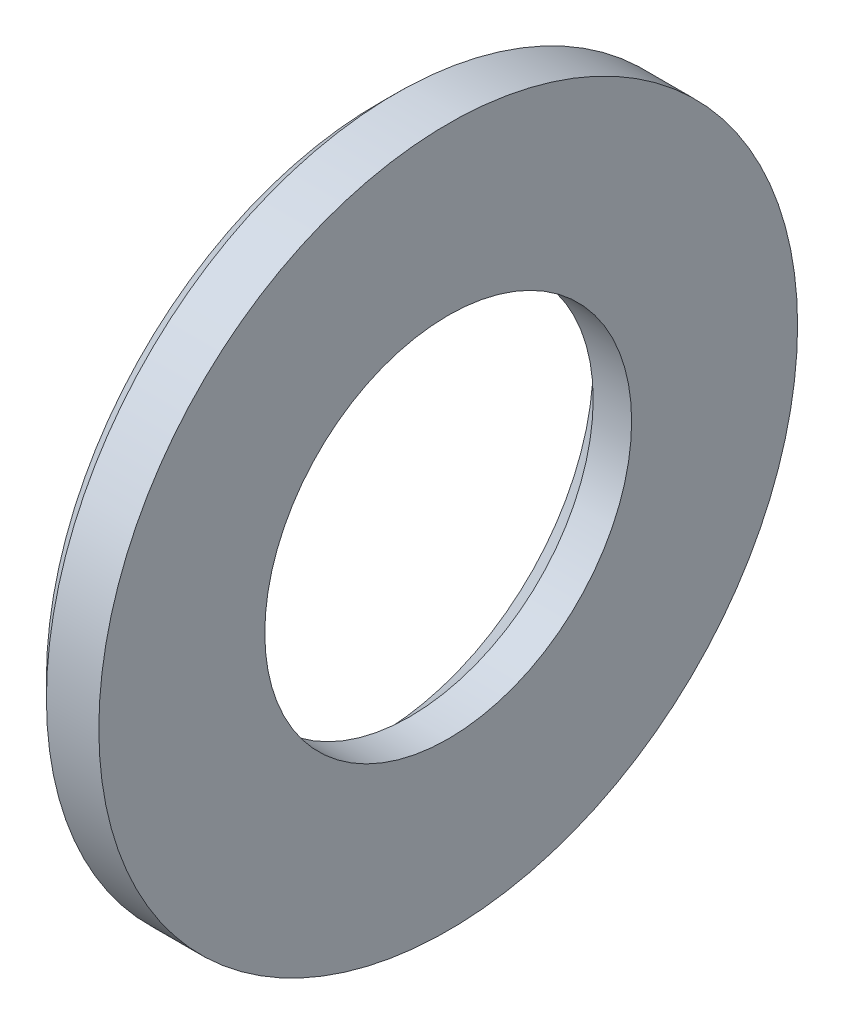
ISO-10303-21;
HEADER;
FILE_DESCRIPTION(('STEP AP214'),'2;1');
FILE_NAME('part.step','',(''),(''),'','','');
FILE_SCHEMA(('AUTOMOTIVE_DESIGN { 1 0 10303 214 1 1 1 1 }'));
ENDSEC;
DATA;
#1=APPLICATION_CONTEXT('core data for automotive mechanical design processes');
#2=APPLICATION_PROTOCOL_DEFINITION('international standard','automotive_design',2000,#1);
#3=PRODUCT_CONTEXT('',#1,'mechanical');
#4=PRODUCT('Part','Part','',(#3));
#5=PRODUCT_RELATED_PRODUCT_CATEGORY('part','',(#4));
#6=PRODUCT_DEFINITION_FORMATION('','',#4);
#7=PRODUCT_DEFINITION_CONTEXT('part definition',#1,'design');
#8=PRODUCT_DEFINITION('design','',#6,#7);
#9=PRODUCT_DEFINITION_SHAPE('','',#8);
#10=(LENGTH_UNIT() NAMED_UNIT(*) SI_UNIT(.MILLI.,.METRE.));
#11=(NAMED_UNIT(*) PLANE_ANGLE_UNIT() SI_UNIT($,.RADIAN.));
#12=(NAMED_UNIT(*) SI_UNIT($,.STERADIAN.) SOLID_ANGLE_UNIT());
#13=UNCERTAINTY_MEASURE_WITH_UNIT(LENGTH_MEASURE(1.E-05),#10,'distance_accuracy_value','');
#14=(GEOMETRIC_REPRESENTATION_CONTEXT(3) GLOBAL_UNCERTAINTY_ASSIGNED_CONTEXT((#13)) GLOBAL_UNIT_ASSIGNED_CONTEXT((#10,
#11,#12)) REPRESENTATION_CONTEXT('',''));
#15=CARTESIAN_POINT('',(0.,0.,0.));
#16=DIRECTION('',(0.,0.,1.));
#17=DIRECTION('',(1.,0.,0.));
#18=AXIS2_PLACEMENT_3D('',#15,#16,#17);
#19=CARTESIAN_POINT('',(-34.9249999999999,0.,0.));
#20=DIRECTION('',(-1.,0.,0.));
#21=DIRECTION('',(0.,0.,1.));
#22=AXIS2_PLACEMENT_3D('',#19,#20,#21);
#23=CYLINDRICAL_SURFACE('',#22,10.5);
#24=CARTESIAN_POINT('',(0.,0.,0.));
#25=DIRECTION('',(-1.,0.,0.));
#26=DIRECTION('',(0.,0.,1.));
#27=AXIS2_PLACEMENT_3D('',#24,#25,#26);
#28=CIRCLE('',#27,10.5);
#29=CARTESIAN_POINT('',(0.,0.,10.5));
#30=VERTEX_POINT('',#29);
#31=EDGE_CURVE('E10',#30,#30,#28,.T.);
#32=ORIENTED_EDGE('',*,*,#31,.F.);
#33=EDGE_LOOP('',(#32));
#34=FACE_BOUND('',#33,.T.);
#35=CARTESIAN_POINT('',(-2.2,0.,0.));
#36=DIRECTION('',(-1.,0.,0.));
#37=DIRECTION('',(0.,0.,1.));
#38=AXIS2_PLACEMENT_3D('',#35,#36,#37);
#39=CIRCLE('',#38,10.5);
#40=CARTESIAN_POINT('',(-2.2,0.,10.5));
#41=VERTEX_POINT('',#40);
#42=EDGE_CURVE('E50',#41,#41,#39,.T.);
#43=ORIENTED_EDGE('',*,*,#42,.T.);
#44=EDGE_LOOP('',(#43));
#45=FACE_BOUND('',#44,.T.);
#46=ADVANCED_FACE('F28',(#34,#45),#23,.F.);
#47=CARTESIAN_POINT('',(0.,10.5,0.));
#48=DIRECTION('',(-1.,0.,0.));
#49=DIRECTION('',(0.,0.,1.));
#50=AXIS2_PLACEMENT_3D('',#47,#48,#49);
#51=PLANE('',#50);
#52=CARTESIAN_POINT('',(0.,0.,0.));
#53=DIRECTION('',(-1.,0.,0.));
#54=DIRECTION('',(0.,0.,1.));
#55=AXIS2_PLACEMENT_3D('',#52,#53,#54);
#56=CIRCLE('',#55,20.);
#57=CARTESIAN_POINT('',(0.,0.,20.));
#58=VERTEX_POINT('',#57);
#59=EDGE_CURVE('E34',#58,#58,#56,.T.);
#60=ORIENTED_EDGE('',*,*,#59,.F.);
#61=EDGE_LOOP('',(#60));
#62=FACE_BOUND('',#61,.T.);
#63=ORIENTED_EDGE('',*,*,#31,.T.);
#64=EDGE_LOOP('',(#63));
#65=FACE_BOUND('',#64,.T.);
#66=ADVANCED_FACE('F67',(#62,#65),#51,.F.);
#67=CARTESIAN_POINT('',(-34.9249999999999,0.,0.));
#68=DIRECTION('',(-1.,0.,0.));
#69=DIRECTION('',(0.,0.,1.));
#70=AXIS2_PLACEMENT_3D('',#67,#68,#69);
#71=CYLINDRICAL_SURFACE('',#70,20.);
#72=CARTESIAN_POINT('',(-3.,0.,0.));
#73=DIRECTION('',(-1.,0.,0.));
#74=DIRECTION('',(0.,0.,1.));
#75=AXIS2_PLACEMENT_3D('',#72,#73,#74);
#76=CIRCLE('',#75,20.);
#77=CARTESIAN_POINT('',(-3.,0.,20.));
#78=VERTEX_POINT('',#77);
#79=EDGE_CURVE('E38',#78,#78,#76,.T.);
#80=ORIENTED_EDGE('',*,*,#79,.F.);
#81=EDGE_LOOP('',(#80));
#82=FACE_BOUND('',#81,.T.);
#83=ORIENTED_EDGE('',*,*,#59,.T.);
#84=EDGE_LOOP('',(#83));
#85=FACE_BOUND('',#84,.T.);
#86=ADVANCED_FACE('F72',(#82,#85),#71,.T.);
#87=CARTESIAN_POINT('',(-4.,0.,0.));
#88=DIRECTION('',(1.,0.,0.));
#89=DIRECTION('',(0.,0.,-1.));
#90=AXIS2_PLACEMENT_3D('',#87,#88,#89);
#91=CONICAL_SURFACE('',#90,19.,0.785398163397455);
#92=ORIENTED_EDGE('',*,*,#79,.T.);
#93=EDGE_LOOP('',(#92));
#94=FACE_BOUND('',#93,.T.);
#95=CARTESIAN_POINT('',(-4.,0.,0.));
#96=DIRECTION('',(-1.,0.,0.));
#97=DIRECTION('',(0.,0.,1.));
#98=AXIS2_PLACEMENT_3D('',#95,#96,#97);
#99=CIRCLE('',#98,19.);
#100=CARTESIAN_POINT('',(-4.,0.,19.));
#101=VERTEX_POINT('',#100);
#102=EDGE_CURVE('E42',#101,#101,#99,.T.);
#103=ORIENTED_EDGE('',*,*,#102,.F.);
#104=EDGE_LOOP('',(#103));
#105=FACE_BOUND('',#104,.T.);
#106=ADVANCED_FACE('F63',(#94,#105),#91,.T.);
#107=CARTESIAN_POINT('',(-4.,19.,0.));
#108=DIRECTION('',(1.,0.,0.));
#109=DIRECTION('',(0.,0.,-1.));
#110=AXIS2_PLACEMENT_3D('',#107,#108,#109);
#111=PLANE('',#110);
#112=CARTESIAN_POINT('',(-4.,0.,0.));
#113=DIRECTION('',(-1.,0.,0.));
#114=DIRECTION('',(0.,0.,1.));
#115=AXIS2_PLACEMENT_3D('',#112,#113,#114);
#116=CIRCLE('',#115,12.3);
#117=CARTESIAN_POINT('',(-4.,0.,12.3));
#118=VERTEX_POINT('',#117);
#119=EDGE_CURVE('E47',#118,#118,#116,.T.);
#120=ORIENTED_EDGE('',*,*,#119,.F.);
#121=EDGE_LOOP('',(#120));
#122=FACE_BOUND('',#121,.T.);
#123=ORIENTED_EDGE('',*,*,#102,.T.);
#124=EDGE_LOOP('',(#123));
#125=FACE_BOUND('',#124,.T.);
#126=ADVANCED_FACE('F57',(#122,#125),#111,.F.);
#127=CARTESIAN_POINT('',(-2.2,0.,0.));
#128=DIRECTION('',(-1.,0.,0.));
#129=DIRECTION('',(0.,0.,1.));
#130=AXIS2_PLACEMENT_3D('',#127,#128,#129);
#131=CONICAL_SURFACE('',#130,10.5,0.785398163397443);
#132=ORIENTED_EDGE('',*,*,#119,.T.);
#133=EDGE_LOOP('',(#132));
#134=FACE_BOUND('',#133,.T.);
#135=ORIENTED_EDGE('',*,*,#42,.F.);
#136=EDGE_LOOP('',(#135));
#137=FACE_BOUND('',#136,.T.);
#138=ADVANCED_FACE('F55',(#134,#137),#131,.F.);
#139=CLOSED_SHELL('',(#46,#66,#86,#106,#126,#138));
#140=MANIFOLD_SOLID_BREP('B2',#139);
#141=ADVANCED_BREP_SHAPE_REPRESENTATION('',(#18,#140),#14);
#142=SHAPE_DEFINITION_REPRESENTATION(#9,#141);
ENDSEC;
END-ISO-10303-21;
